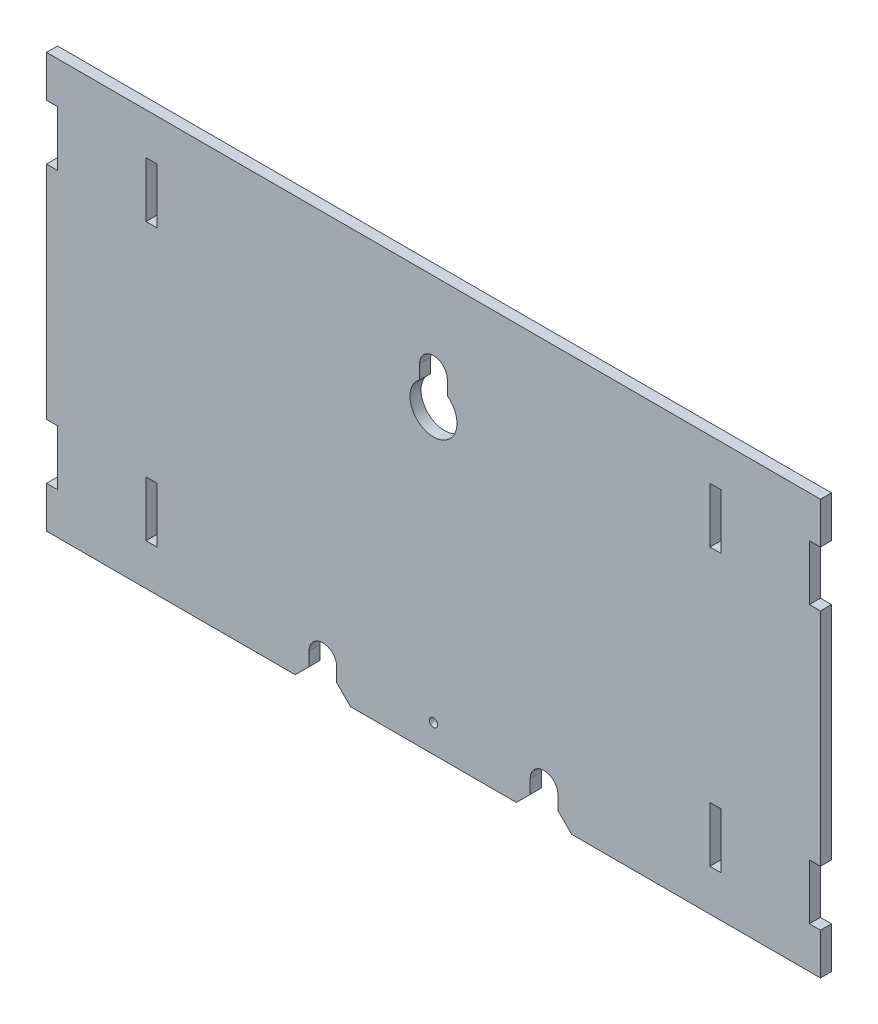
from build123d import *

# Parameters (mm, degrees)
SKETCH1_R      = 1.5
SKETCH1_W      = 4
SKETCH1_H      = 20
EXTRUDE1_DEPTH = 4
CHAMFER1_SIZE  = 5


with BuildPart() as part:
    # Sketch1 → Extrude1 (new body)
    with BuildSketch(Plane.XY):
        with BuildLine():
            Line((-140, 150), (140, 150))
            Line((140, 150), (140, 135))
            Line((140, 135), (136, 135))
            Line((136, 135), (136, 115))
            Line((136, 115), (140, 115))
            Line((140, 115), (140, 35))
            Line((140, 35), (136, 35))
            Line((136, 35), (136, 15))
            Line((136, 15), (140, 15))
            Line((140, 15), (140, 0))
            Line((140, 0), (45, 0))
            Line((45, 0), (45, 10))
            ThreePointArc((45, 10), (40, 15), (35, 10))
            Line((35, 10), (35, 0))
            Line((35, 0), (-35, 0))
            Line((-35, 0), (-35, 10))
            ThreePointArc((-35, 10), (-40, 15), (-45, 10))
            Line((-45, 10), (-45, 0))
            Line((-45, 0), (-140, 0))
            Line((-140, 0), (-140, 15))
            Line((-140, 15), (-136, 15))
            Line((-136, 15), (-136, 35))
            Line((-136, 35), (-140, 35))
            Line((-140, 35), (-140, 115))
            Line((-140, 115), (-136, 115))
            Line((-136, 115), (-136, 135))
            Line((-136, 135), (-140, 135))
            Line((-140, 135), (-140, 150))
        make_face()
        with Locations((0, 10)):
            Circle(SKETCH1_R, mode=Mode.SUBTRACT)
        with Locations((-102, 25)):
            Rectangle(SKETCH1_W, SKETCH1_H, mode=Mode.SUBTRACT)
        with Locations((-102, 125)):
            Rectangle(SKETCH1_W, SKETCH1_H, mode=Mode.SUBTRACT)
        with Locations((102, 25)):
            Rectangle(SKETCH1_W, SKETCH1_H, mode=Mode.SUBTRACT)
        with Locations((102, 125)):
            Rectangle(SKETCH1_W, SKETCH1_H, mode=Mode.SUBTRACT)
        with BuildLine():
            Line((-5, 114.873863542), (-5, 120))
            ThreePointArc((-5, 120), (0, 125), (5, 120))
            Line((5, 120), (5, 114.873863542))
            ThreePointArc((5, 114.873863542), (0, 99.5), (-5, 114.873863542))
        make_face(mode=Mode.SUBTRACT)
    extrude(amount=EXTRUDE1_DEPTH)

    # Chamfer1
    chamfer1_edges = [part.edges().sort_by_distance(p)[0] for p in [
        (45, 0, 2),
        (35, 0, 2),
        (-35, 0, 2),
        (-45, 0, 2),
    ]]
    chamfer(chamfer1_edges, length=CHAMFER1_SIZE)


solid = part.part
